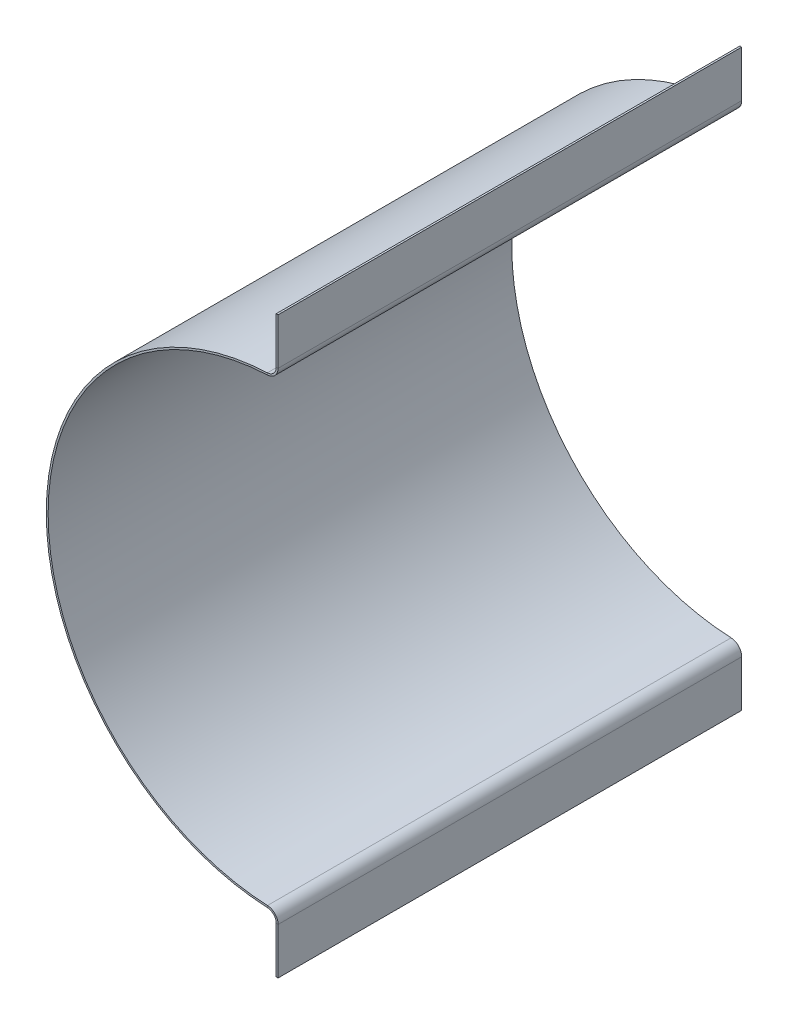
ISO-10303-21;
HEADER;
FILE_DESCRIPTION(('STEP AP214'),'2;1');
FILE_NAME('part.step','',(''),(''),'','','');
FILE_SCHEMA(('AUTOMOTIVE_DESIGN { 1 0 10303 214 1 1 1 1 }'));
ENDSEC;
DATA;
#1=APPLICATION_CONTEXT('core data for automotive mechanical design processes');
#2=APPLICATION_PROTOCOL_DEFINITION('international standard','automotive_design',2000,#1);
#3=PRODUCT_CONTEXT('',#1,'mechanical');
#4=PRODUCT('Part','Part','',(#3));
#5=PRODUCT_RELATED_PRODUCT_CATEGORY('part','',(#4));
#6=PRODUCT_DEFINITION_FORMATION('','',#4);
#7=PRODUCT_DEFINITION_CONTEXT('part definition',#1,'design');
#8=PRODUCT_DEFINITION('design','',#6,#7);
#9=PRODUCT_DEFINITION_SHAPE('','',#8);
#10=(LENGTH_UNIT() NAMED_UNIT(*) SI_UNIT(.MILLI.,.METRE.));
#11=(NAMED_UNIT(*) PLANE_ANGLE_UNIT() SI_UNIT($,.RADIAN.));
#12=(NAMED_UNIT(*) SI_UNIT($,.STERADIAN.) SOLID_ANGLE_UNIT());
#13=UNCERTAINTY_MEASURE_WITH_UNIT(LENGTH_MEASURE(1.E-05),#10,'distance_accuracy_value','');
#14=(GEOMETRIC_REPRESENTATION_CONTEXT(3) GLOBAL_UNCERTAINTY_ASSIGNED_CONTEXT((#13)) GLOBAL_UNIT_ASSIGNED_CONTEXT((#10,
#11,#12)) REPRESENTATION_CONTEXT('',''));
#15=CARTESIAN_POINT('',(0.,0.,0.));
#16=DIRECTION('',(0.,0.,1.));
#17=DIRECTION('',(1.,0.,0.));
#18=AXIS2_PLACEMENT_3D('',#15,#16,#17);
#19=CARTESIAN_POINT('',(-1.016,-157.339248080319,254.));
#20=DIRECTION('',(-1.,0.,0.));
#21=DIRECTION('',(0.,-1.,0.));
#22=AXIS2_PLACEMENT_3D('',#19,#20,#21);
#23=PLANE('',#22);
#24=DIRECTION('',(0.,0.,1.));
#25=VECTOR('',#24,1.);
#26=CARTESIAN_POINT('',(-1.01599999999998,-144.639248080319,254.));
#27=LINE('',#26,#25);
#28=CARTESIAN_POINT('',(-1.01599999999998,-144.639248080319,215.9));
#29=VERTEX_POINT('',#28);
#30=CARTESIAN_POINT('',(-1.01599999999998,-144.639248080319,241.3));
#31=VERTEX_POINT('',#30);
#32=EDGE_CURVE('E49',#29,#31,#27,.T.);
#33=ORIENTED_EDGE('',*,*,#32,.T.);
#34=DIRECTION('',(0.,1.,0.));
#35=VECTOR('',#34,1.);
#36=CARTESIAN_POINT('',(-1.016,-157.339248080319,241.3));
#37=LINE('',#36,#35);
#38=CARTESIAN_POINT('',(-1.01599999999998,-131.939248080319,241.3));
#39=VERTEX_POINT('',#38);
#40=EDGE_CURVE('E11',#31,#39,#37,.T.);
#41=ORIENTED_EDGE('',*,*,#40,.T.);
#42=DIRECTION('',(0.,0.,-1.));
#43=VECTOR('',#42,1.);
#44=CARTESIAN_POINT('',(-1.01599999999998,-131.939248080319,254.));
#45=LINE('',#44,#43);
#46=CARTESIAN_POINT('',(-1.01599999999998,-131.939248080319,215.9));
#47=VERTEX_POINT('',#46);
#48=EDGE_CURVE('E291',#39,#47,#45,.T.);
#49=ORIENTED_EDGE('',*,*,#48,.T.);
#50=DIRECTION('',(0.,-1.,0.));
#51=VECTOR('',#50,1.);
#52=CARTESIAN_POINT('',(-1.016,-157.339248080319,215.9));
#53=LINE('',#52,#51);
#54=EDGE_CURVE('E359',#47,#29,#53,.T.);
#55=ORIENTED_EDGE('',*,*,#54,.T.);
#56=EDGE_LOOP('',(#33,#41,#49,#55));
#57=FACE_BOUND('',#56,.T.);
#58=ADVANCED_FACE('F40',(#57),#23,.T.);
#59=DIRECTION('',(0.,0.,1.));
#60=VECTOR('',#59,1.);
#61=CARTESIAN_POINT('',(-1.01599999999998,-144.639248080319,254.));
#62=LINE('',#61,#60);
#63=CARTESIAN_POINT('',(-1.01599999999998,-144.639248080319,165.1));
#64=VERTEX_POINT('',#63);
#65=CARTESIAN_POINT('',(-1.01599999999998,-144.639248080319,190.5));
#66=VERTEX_POINT('',#65);
#67=EDGE_CURVE('E352',#64,#66,#62,.T.);
#68=ORIENTED_EDGE('',*,*,#67,.T.);
#69=DIRECTION('',(0.,1.,0.));
#70=VECTOR('',#69,1.);
#71=CARTESIAN_POINT('',(-1.016,-157.339248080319,190.5));
#72=LINE('',#71,#70);
#73=CARTESIAN_POINT('',(-1.01599999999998,-131.939248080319,190.5));
#74=VERTEX_POINT('',#73);
#75=EDGE_CURVE('E356',#66,#74,#72,.T.);
#76=ORIENTED_EDGE('',*,*,#75,.T.);
#77=CARTESIAN_POINT('',(-1.01599999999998,-131.939248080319,165.1));
#78=VERTEX_POINT('',#77);
#79=EDGE_CURVE('E378',#74,#78,#45,.T.);
#80=ORIENTED_EDGE('',*,*,#79,.T.);
#81=DIRECTION('',(0.,-1.,0.));
#82=VECTOR('',#81,1.);
#83=CARTESIAN_POINT('',(-1.016,-157.339248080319,165.1));
#84=LINE('',#83,#82);
#85=EDGE_CURVE('E348',#78,#64,#84,.T.);
#86=ORIENTED_EDGE('',*,*,#85,.T.);
#87=EDGE_LOOP('',(#68,#76,#80,#86));
#88=FACE_BOUND('',#87,.T.);
#89=ADVANCED_FACE('F464',(#88),#23,.T.);
#90=DIRECTION('',(0.,0.,1.));
#91=VECTOR('',#90,1.);
#92=CARTESIAN_POINT('',(-1.01599999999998,-144.639248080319,254.));
#93=LINE('',#92,#91);
#94=CARTESIAN_POINT('',(-1.01599999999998,-144.639248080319,114.3));
#95=VERTEX_POINT('',#94);
#96=CARTESIAN_POINT('',(-1.01599999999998,-144.639248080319,139.7));
#97=VERTEX_POINT('',#96);
#98=EDGE_CURVE('E341',#95,#97,#93,.T.);
#99=ORIENTED_EDGE('',*,*,#98,.T.);
#100=DIRECTION('',(0.,1.,0.));
#101=VECTOR('',#100,1.);
#102=CARTESIAN_POINT('',(-1.016,-157.339248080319,139.7));
#103=LINE('',#102,#101);
#104=CARTESIAN_POINT('',(-1.01599999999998,-131.939248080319,139.7));
#105=VERTEX_POINT('',#104);
#106=EDGE_CURVE('E345',#97,#105,#103,.T.);
#107=ORIENTED_EDGE('',*,*,#106,.T.);
#108=CARTESIAN_POINT('',(-1.01599999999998,-131.939248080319,114.3));
#109=VERTEX_POINT('',#108);
#110=EDGE_CURVE('E382',#105,#109,#45,.T.);
#111=ORIENTED_EDGE('',*,*,#110,.T.);
#112=DIRECTION('',(0.,-1.,0.));
#113=VECTOR('',#112,1.);
#114=CARTESIAN_POINT('',(-1.016,-157.339248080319,114.3));
#115=LINE('',#114,#113);
#116=EDGE_CURVE('E337',#109,#95,#115,.T.);
#117=ORIENTED_EDGE('',*,*,#116,.T.);
#118=EDGE_LOOP('',(#99,#107,#111,#117));
#119=FACE_BOUND('',#118,.T.);
#120=ADVANCED_FACE('F469',(#119),#23,.T.);
#121=DIRECTION('',(0.,0.,1.));
#122=VECTOR('',#121,1.);
#123=CARTESIAN_POINT('',(-1.01599999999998,-144.639248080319,254.));
#124=LINE('',#123,#122);
#125=CARTESIAN_POINT('',(-1.01599999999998,-144.639248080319,63.5));
#126=VERTEX_POINT('',#125);
#127=CARTESIAN_POINT('',(-1.01599999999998,-144.639248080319,88.9));
#128=VERTEX_POINT('',#127);
#129=EDGE_CURVE('E330',#126,#128,#124,.T.);
#130=ORIENTED_EDGE('',*,*,#129,.T.);
#131=DIRECTION('',(0.,1.,0.));
#132=VECTOR('',#131,1.);
#133=CARTESIAN_POINT('',(-1.016,-157.339248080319,88.9));
#134=LINE('',#133,#132);
#135=CARTESIAN_POINT('',(-1.01599999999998,-131.939248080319,88.9));
#136=VERTEX_POINT('',#135);
#137=EDGE_CURVE('E334',#128,#136,#134,.T.);
#138=ORIENTED_EDGE('',*,*,#137,.T.);
#139=CARTESIAN_POINT('',(-1.01599999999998,-131.939248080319,63.5));
#140=VERTEX_POINT('',#139);
#141=EDGE_CURVE('E388',#136,#140,#45,.T.);
#142=ORIENTED_EDGE('',*,*,#141,.T.);
#143=DIRECTION('',(0.,-1.,0.));
#144=VECTOR('',#143,1.);
#145=CARTESIAN_POINT('',(-1.016,-157.339248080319,63.4999999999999));
#146=LINE('',#145,#144);
#147=EDGE_CURVE('E326',#140,#126,#146,.T.);
#148=ORIENTED_EDGE('',*,*,#147,.T.);
#149=EDGE_LOOP('',(#130,#138,#142,#148));
#150=FACE_BOUND('',#149,.T.);
#151=ADVANCED_FACE('F480',(#150),#23,.T.);
#152=DIRECTION('',(0.,0.,1.));
#153=VECTOR('',#152,1.);
#154=CARTESIAN_POINT('',(-1.01599999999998,-144.639248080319,254.));
#155=LINE('',#154,#153);
#156=CARTESIAN_POINT('',(-1.01599999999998,-144.639248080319,12.7));
#157=VERTEX_POINT('',#156);
#158=CARTESIAN_POINT('',(-1.01599999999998,-144.639248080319,38.1));
#159=VERTEX_POINT('',#158);
#160=EDGE_CURVE('E319',#157,#159,#155,.T.);
#161=ORIENTED_EDGE('',*,*,#160,.T.);
#162=DIRECTION('',(0.,1.,0.));
#163=VECTOR('',#162,1.);
#164=CARTESIAN_POINT('',(-1.016,-157.339248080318,38.0999999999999));
#165=LINE('',#164,#163);
#166=CARTESIAN_POINT('',(-1.01599999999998,-131.939248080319,38.1));
#167=VERTEX_POINT('',#166);
#168=EDGE_CURVE('E323',#159,#167,#165,.T.);
#169=ORIENTED_EDGE('',*,*,#168,.T.);
#170=CARTESIAN_POINT('',(-1.01599999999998,-131.939248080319,12.7));
#171=VERTEX_POINT('',#170);
#172=EDGE_CURVE('E395',#167,#171,#45,.T.);
#173=ORIENTED_EDGE('',*,*,#172,.T.);
#174=DIRECTION('',(0.,-1.,0.));
#175=VECTOR('',#174,1.);
#176=CARTESIAN_POINT('',(-1.016,-157.339248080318,12.6999999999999));
#177=LINE('',#176,#175);
#178=EDGE_CURVE('E315',#171,#157,#177,.T.);
#179=ORIENTED_EDGE('',*,*,#178,.T.);
#180=EDGE_LOOP('',(#161,#169,#173,#179));
#181=FACE_BOUND('',#180,.T.);
#182=ADVANCED_FACE('F473',(#181),#23,.T.);
#183=CARTESIAN_POINT('',(-1.016,131.939248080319,254.));
#184=DIRECTION('',(0.,0.,1.));
#185=DIRECTION('',(1.,0.,0.));
#186=AXIS2_PLACEMENT_3D('',#183,#184,#185);
#187=PLANE('',#186);
#188=DIRECTION('',(1.,0.,0.));
#189=VECTOR('',#188,1.);
#190=CARTESIAN_POINT('',(-1.016,131.939248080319,254.));
#191=LINE('',#190,#189);
#192=CARTESIAN_POINT('',(-1.016,131.939248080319,254.));
#193=VERTEX_POINT('',#192);
#194=CARTESIAN_POINT('',(0.,131.939248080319,254.));
#195=VERTEX_POINT('',#194);
#196=EDGE_CURVE('E192',#193,#195,#191,.T.);
#197=ORIENTED_EDGE('',*,*,#196,.F.);
#198=CARTESIAN_POINT('',(-6.096,131.939248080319,254.));
#199=DIRECTION('',(0.,0.,1.));
#200=DIRECTION('',(-1.,0.,0.));
#201=AXIS2_PLACEMENT_3D('',#198,#199,#200);
#202=CIRCLE('',#201,5.08);
#203=CARTESIAN_POINT('',(-5.86153846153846,126.864661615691,254.));
#204=VERTEX_POINT('',#203);
#205=EDGE_CURVE('E212',#204,#193,#202,.T.);
#206=ORIENTED_EDGE('',*,*,#205,.F.);
#207=DIRECTION('',(0.0461538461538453,-0.998934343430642,0.));
#208=VECTOR('',#207,1.);
#209=CARTESIAN_POINT('',(-5.86153846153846,126.864661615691,254.));
#210=LINE('',#209,#208);
#211=CARTESIAN_POINT('',(-5.81464615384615,125.849744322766,254.));
#212=VERTEX_POINT('',#211);
#213=EDGE_CURVE('E310',#204,#212,#210,.T.);
#214=ORIENTED_EDGE('',*,*,#213,.T.);
#215=CARTESIAN_POINT('',(-6.096,131.939248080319,254.));
#216=DIRECTION('',(0.,0.,1.));
#217=DIRECTION('',(1.,0.,0.));
#218=AXIS2_PLACEMENT_3D('',#215,#216,#217);
#219=CIRCLE('',#218,6.096);
#220=EDGE_CURVE('E238',#212,#195,#219,.T.);
#221=ORIENTED_EDGE('',*,*,#220,.T.);
#222=EDGE_LOOP('',(#197,#206,#214,#221));
#223=FACE_BOUND('',#222,.T.);
#224=ADVANCED_FACE('F42',(#223),#187,.T.);
#225=CARTESIAN_POINT('',(0.,131.939248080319,0.));
#226=DIRECTION('',(0.,0.,-1.));
#227=DIRECTION('',(-1.,0.,0.));
#228=AXIS2_PLACEMENT_3D('',#225,#226,#227);
#229=PLANE('',#228);
#230=DIRECTION('',(-1.,0.,0.));
#231=VECTOR('',#230,1.);
#232=CARTESIAN_POINT('',(0.,131.939248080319,0.));
#233=LINE('',#232,#231);
#234=CARTESIAN_POINT('',(0.,131.939248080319,0.));
#235=VERTEX_POINT('',#234);
#236=CARTESIAN_POINT('',(-1.016,131.939248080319,0.));
#237=VERTEX_POINT('',#236);
#238=EDGE_CURVE('E312',#235,#237,#233,.T.);
#239=ORIENTED_EDGE('',*,*,#238,.F.);
#240=CARTESIAN_POINT('',(-6.096,131.939248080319,0.));
#241=DIRECTION('',(0.,0.,1.));
#242=DIRECTION('',(1.,0.,0.));
#243=AXIS2_PLACEMENT_3D('',#240,#241,#242);
#244=CIRCLE('',#243,6.096);
#245=CARTESIAN_POINT('',(-5.81464615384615,125.849744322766,0.));
#246=VERTEX_POINT('',#245);
#247=EDGE_CURVE('E196',#246,#235,#244,.T.);
#248=ORIENTED_EDGE('',*,*,#247,.F.);
#249=DIRECTION('',(-0.0461538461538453,0.998934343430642,0.));
#250=VECTOR('',#249,1.);
#251=CARTESIAN_POINT('',(-5.81464615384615,125.849744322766,0.));
#252=LINE('',#251,#250);
#253=CARTESIAN_POINT('',(-5.86153846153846,126.864661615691,0.));
#254=VERTEX_POINT('',#253);
#255=EDGE_CURVE('E308',#246,#254,#252,.T.);
#256=ORIENTED_EDGE('',*,*,#255,.T.);
#257=CARTESIAN_POINT('',(-6.096,131.939248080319,0.));
#258=DIRECTION('',(0.,0.,1.));
#259=DIRECTION('',(-1.,0.,0.));
#260=AXIS2_PLACEMENT_3D('',#257,#258,#259);
#261=CIRCLE('',#260,5.08);
#262=EDGE_CURVE('E247',#254,#237,#261,.T.);
#263=ORIENTED_EDGE('',*,*,#262,.T.);
#264=EDGE_LOOP('',(#239,#248,#256,#263));
#265=FACE_BOUND('',#264,.T.);
#266=ADVANCED_FACE('F446',(#265),#229,.T.);
#267=CARTESIAN_POINT('',(-5.86153846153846,126.864661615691,254.));
#268=DIRECTION('',(0.,0.,1.));
#269=DIRECTION('',(1.,0.,0.));
#270=AXIS2_PLACEMENT_3D('',#267,#268,#269);
#271=PLANE('',#270);
#272=ORIENTED_EDGE('',*,*,#213,.F.);
#273=CARTESIAN_POINT('',(0.,0.,254.));
#274=DIRECTION('',(0.,0.,-1.));
#275=DIRECTION('',(1.,0.,0.));
#276=AXIS2_PLACEMENT_3D('',#273,#274,#275);
#277=CIRCLE('',#276,127.);
#278=CARTESIAN_POINT('',(-5.86153846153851,-126.864661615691,254.));
#279=VERTEX_POINT('',#278);
#280=EDGE_CURVE('E217',#279,#204,#277,.T.);
#281=ORIENTED_EDGE('',*,*,#280,.F.);
#282=DIRECTION('',(0.0461538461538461,0.998934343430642,0.));
#283=VECTOR('',#282,1.);
#284=CARTESIAN_POINT('',(-5.86153846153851,-126.864661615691,254.));
#285=LINE('',#284,#283);
#286=CARTESIAN_POINT('',(-5.8146461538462,-125.849744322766,254.));
#287=VERTEX_POINT('',#286);
#288=EDGE_CURVE('E306',#279,#287,#285,.T.);
#289=ORIENTED_EDGE('',*,*,#288,.T.);
#290=CARTESIAN_POINT('',(0.,0.,254.));
#291=DIRECTION('',(0.,0.,1.));
#292=DIRECTION('',(1.,0.,0.));
#293=AXIS2_PLACEMENT_3D('',#290,#291,#292);
#294=CIRCLE('',#293,125.984);
#295=EDGE_CURVE('E235',#287,#212,#294,.F.);
#296=ORIENTED_EDGE('',*,*,#295,.T.);
#297=EDGE_LOOP('',(#272,#281,#289,#296));
#298=FACE_BOUND('',#297,.T.);
#299=ADVANCED_FACE('F429',(#298),#271,.T.);
#300=CARTESIAN_POINT('',(-5.81464615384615,125.849744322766,0.));
#301=DIRECTION('',(0.,0.,-1.));
#302=DIRECTION('',(-1.,0.,0.));
#303=AXIS2_PLACEMENT_3D('',#300,#301,#302);
#304=PLANE('',#303);
#305=ORIENTED_EDGE('',*,*,#255,.F.);
#306=CARTESIAN_POINT('',(0.,0.,0.));
#307=DIRECTION('',(0.,0.,1.));
#308=DIRECTION('',(1.,0.,0.));
#309=AXIS2_PLACEMENT_3D('',#306,#307,#308);
#310=CIRCLE('',#309,125.984);
#311=CARTESIAN_POINT('',(-5.8146461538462,-125.849744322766,0.));
#312=VERTEX_POINT('',#311);
#313=EDGE_CURVE('E268',#312,#246,#310,.F.);
#314=ORIENTED_EDGE('',*,*,#313,.F.);
#315=DIRECTION('',(-0.0461538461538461,-0.998934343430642,0.));
#316=VECTOR('',#315,1.);
#317=CARTESIAN_POINT('',(-5.8146461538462,-125.849744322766,0.));
#318=LINE('',#317,#316);
#319=CARTESIAN_POINT('',(-5.86153846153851,-126.864661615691,0.));
#320=VERTEX_POINT('',#319);
#321=EDGE_CURVE('E206',#312,#320,#318,.T.);
#322=ORIENTED_EDGE('',*,*,#321,.T.);
#323=CARTESIAN_POINT('',(0.,0.,0.));
#324=DIRECTION('',(0.,0.,-1.));
#325=DIRECTION('',(1.,0.,0.));
#326=AXIS2_PLACEMENT_3D('',#323,#324,#325);
#327=CIRCLE('',#326,127.);
#328=EDGE_CURVE('E250',#320,#254,#327,.T.);
#329=ORIENTED_EDGE('',*,*,#328,.T.);
#330=EDGE_LOOP('',(#305,#314,#322,#329));
#331=FACE_BOUND('',#330,.T.);
#332=ADVANCED_FACE('F450',(#331),#304,.T.);
#333=CARTESIAN_POINT('',(-5.86153846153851,-126.864661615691,254.));
#334=DIRECTION('',(0.,0.,1.));
#335=DIRECTION('',(1.,0.,0.));
#336=AXIS2_PLACEMENT_3D('',#333,#334,#335);
#337=PLANE('',#336);
#338=ORIENTED_EDGE('',*,*,#288,.F.);
#339=CARTESIAN_POINT('',(-6.09599999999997,-131.939248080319,254.));
#340=DIRECTION('',(0.,0.,1.));
#341=DIRECTION('',(1.,0.,0.));
#342=AXIS2_PLACEMENT_3D('',#339,#340,#341);
#343=CIRCLE('',#342,5.07999999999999);
#344=CARTESIAN_POINT('',(-1.01599999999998,-131.939248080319,254.));
#345=VERTEX_POINT('',#344);
#346=EDGE_CURVE('E220',#345,#279,#343,.T.);
#347=ORIENTED_EDGE('',*,*,#346,.F.);
#348=DIRECTION('',(-1.,0.,0.));
#349=VECTOR('',#348,1.);
#350=CARTESIAN_POINT('',(0.,-131.939248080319,254.));
#351=LINE('',#350,#349);
#352=CARTESIAN_POINT('',(0.,-131.939248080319,254.));
#353=VERTEX_POINT('',#352);
#354=EDGE_CURVE('E304',#353,#345,#351,.T.);
#355=ORIENTED_EDGE('',*,*,#354,.F.);
#356=CARTESIAN_POINT('',(-6.09599999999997,-131.939248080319,254.));
#357=DIRECTION('',(0.,0.,1.));
#358=DIRECTION('',(1.,0.,0.));
#359=AXIS2_PLACEMENT_3D('',#356,#357,#358);
#360=CIRCLE('',#359,6.09599999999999);
#361=EDGE_CURVE('E232',#353,#287,#360,.T.);
#362=ORIENTED_EDGE('',*,*,#361,.T.);
#363=EDGE_LOOP('',(#338,#347,#355,#362));
#364=FACE_BOUND('',#363,.T.);
#365=ADVANCED_FACE('F422',(#364),#337,.T.);
#366=CARTESIAN_POINT('',(0.,-131.939248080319,254.));
#367=DIRECTION('',(0.,0.,1.));
#368=DIRECTION('',(1.,0.,0.));
#369=AXIS2_PLACEMENT_3D('',#366,#367,#368);
#370=PLANE('',#369);
#371=DIRECTION('',(0.,1.,0.));
#372=VECTOR('',#371,1.);
#373=CARTESIAN_POINT('',(-1.016,157.339248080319,254.));
#374=LINE('',#373,#372);
#375=CARTESIAN_POINT('',(-1.016,157.339248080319,254.));
#376=VERTEX_POINT('',#375);
#377=EDGE_CURVE('E210',#193,#376,#374,.T.);
#378=ORIENTED_EDGE('',*,*,#377,.F.);
#379=ORIENTED_EDGE('',*,*,#196,.T.);
#380=DIRECTION('',(0.,1.,0.));
#381=VECTOR('',#380,1.);
#382=CARTESIAN_POINT('',(0.,157.339248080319,254.));
#383=LINE('',#382,#381);
#384=CARTESIAN_POINT('',(0.,157.339248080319,254.));
#385=VERTEX_POINT('',#384);
#386=EDGE_CURVE('E185',#195,#385,#383,.T.);
#387=ORIENTED_EDGE('',*,*,#386,.T.);
#388=DIRECTION('',(1.,0.,0.));
#389=VECTOR('',#388,1.);
#390=CARTESIAN_POINT('',(-1.016,157.339248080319,254.));
#391=LINE('',#390,#389);
#392=EDGE_CURVE('E190',#376,#385,#391,.T.);
#393=ORIENTED_EDGE('',*,*,#392,.F.);
#394=EDGE_LOOP('',(#378,#379,#387,#393));
#395=FACE_BOUND('',#394,.T.);
#396=ADVANCED_FACE('F188',(#395),#370,.T.);
#397=CARTESIAN_POINT('',(-1.01599999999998,-131.939248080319,0.));
#398=DIRECTION('',(0.,0.,-1.));
#399=DIRECTION('',(-1.,0.,0.));
#400=AXIS2_PLACEMENT_3D('',#397,#398,#399);
#401=PLANE('',#400);
#402=DIRECTION('',(1.,0.,0.));
#403=VECTOR('',#402,1.);
#404=CARTESIAN_POINT('',(-1.01599999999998,-131.939248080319,0.));
#405=LINE('',#404,#403);
#406=CARTESIAN_POINT('',(-1.01599999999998,-131.939248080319,0.));
#407=VERTEX_POINT('',#406);
#408=CARTESIAN_POINT('',(0.,-131.939248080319,0.));
#409=VERTEX_POINT('',#408);
#410=EDGE_CURVE('E302',#407,#409,#405,.T.);
#411=ORIENTED_EDGE('',*,*,#410,.F.);
#412=CARTESIAN_POINT('',(-6.09599999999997,-131.939248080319,0.));
#413=DIRECTION('',(0.,0.,1.));
#414=DIRECTION('',(1.,0.,0.));
#415=AXIS2_PLACEMENT_3D('',#412,#413,#414);
#416=CIRCLE('',#415,5.07999999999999);
#417=EDGE_CURVE('E253',#407,#320,#416,.T.);
#418=ORIENTED_EDGE('',*,*,#417,.T.);
#419=ORIENTED_EDGE('',*,*,#321,.F.);
#420=CARTESIAN_POINT('',(-6.09599999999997,-131.939248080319,0.));
#421=DIRECTION('',(0.,0.,1.));
#422=DIRECTION('',(1.,0.,0.));
#423=AXIS2_PLACEMENT_3D('',#420,#421,#422);
#424=CIRCLE('',#423,6.09599999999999);
#425=EDGE_CURVE('E265',#409,#312,#424,.T.);
#426=ORIENTED_EDGE('',*,*,#425,.F.);
#427=EDGE_LOOP('',(#411,#418,#419,#426));
#428=FACE_BOUND('',#427,.T.);
#429=ADVANCED_FACE('F405',(#428),#401,.T.);
#430=CARTESIAN_POINT('',(-5.8146461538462,-125.849744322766,0.));
#431=DIRECTION('',(0.,0.,-1.));
#432=DIRECTION('',(-1.,0.,0.));
#433=AXIS2_PLACEMENT_3D('',#430,#431,#432);
#434=PLANE('',#433);
#435=DIRECTION('',(0.,1.,0.));
#436=VECTOR('',#435,1.);
#437=CARTESIAN_POINT('',(-1.016,-157.339248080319,0.));
#438=LINE('',#437,#436);
#439=CARTESIAN_POINT('',(-1.016,-157.339248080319,0.));
#440=VERTEX_POINT('',#439);
#441=EDGE_CURVE('E256',#440,#407,#438,.T.);
#442=ORIENTED_EDGE('',*,*,#441,.T.);
#443=ORIENTED_EDGE('',*,*,#410,.T.);
#444=DIRECTION('',(0.,1.,0.));
#445=VECTOR('',#444,1.);
#446=CARTESIAN_POINT('',(0.,-157.339248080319,0.));
#447=LINE('',#446,#445);
#448=CARTESIAN_POINT('',(0.,-157.339248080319,0.));
#449=VERTEX_POINT('',#448);
#450=EDGE_CURVE('E262',#449,#409,#447,.T.);
#451=ORIENTED_EDGE('',*,*,#450,.F.);
#452=DIRECTION('',(-1.,0.,0.));
#453=VECTOR('',#452,1.);
#454=CARTESIAN_POINT('',(0.,-157.339248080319,0.));
#455=LINE('',#454,#453);
#456=EDGE_CURVE('E259',#449,#440,#455,.T.);
#457=ORIENTED_EDGE('',*,*,#456,.T.);
#458=EDGE_LOOP('',(#442,#443,#451,#457));
#459=FACE_BOUND('',#458,.T.);
#460=ADVANCED_FACE('F410',(#459),#434,.T.);
#461=CARTESIAN_POINT('',(0.,157.339248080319,254.));
#462=DIRECTION('',(-1.,0.,0.));
#463=DIRECTION('',(0.,-1.,0.));
#464=AXIS2_PLACEMENT_3D('',#461,#462,#463);
#465=PLANE('',#464);
#466=DIRECTION('',(0.,1.,0.));
#467=VECTOR('',#466,1.);
#468=CARTESIAN_POINT('',(0.,157.339248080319,0.));
#469=LINE('',#468,#467);
#470=CARTESIAN_POINT('',(0.,157.339248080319,0.));
#471=VERTEX_POINT('',#470);
#472=EDGE_CURVE('E202',#235,#471,#469,.T.);
#473=ORIENTED_EDGE('',*,*,#472,.T.);
#474=DIRECTION('',(0.,0.,-1.));
#475=VECTOR('',#474,1.);
#476=CARTESIAN_POINT('',(0.,157.339248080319,254.));
#477=LINE('',#476,#475);
#478=EDGE_CURVE('E199',#385,#471,#477,.T.);
#479=ORIENTED_EDGE('',*,*,#478,.F.);
#480=ORIENTED_EDGE('',*,*,#386,.F.);
#481=DIRECTION('',(0.,0.,-1.));
#482=VECTOR('',#481,1.);
#483=CARTESIAN_POINT('',(0.,131.939248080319,254.));
#484=LINE('',#483,#482);
#485=EDGE_CURVE('E240',#195,#235,#484,.T.);
#486=ORIENTED_EDGE('',*,*,#485,.T.);
#487=EDGE_LOOP('',(#473,#479,#480,#486));
#488=FACE_BOUND('',#487,.T.);
#489=ADVANCED_FACE('F200',(#488),#465,.F.);
#490=CARTESIAN_POINT('',(-1.016,157.339248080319,254.));
#491=DIRECTION('',(0.,1.,0.));
#492=DIRECTION('',(0.,0.,1.));
#493=AXIS2_PLACEMENT_3D('',#490,#491,#492);
#494=PLANE('',#493);
#495=DIRECTION('',(1.,0.,0.));
#496=VECTOR('',#495,1.);
#497=CARTESIAN_POINT('',(-1.016,157.339248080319,0.));
#498=LINE('',#497,#496);
#499=CARTESIAN_POINT('',(-1.016,157.339248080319,0.));
#500=VERTEX_POINT('',#499);
#501=EDGE_CURVE('E242',#500,#471,#498,.T.);
#502=ORIENTED_EDGE('',*,*,#501,.F.);
#503=DIRECTION('',(0.,0.,-1.));
#504=VECTOR('',#503,1.);
#505=CARTESIAN_POINT('',(-1.016,157.339248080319,254.));
#506=LINE('',#505,#504);
#507=EDGE_CURVE('E207',#376,#500,#506,.T.);
#508=ORIENTED_EDGE('',*,*,#507,.F.);
#509=ORIENTED_EDGE('',*,*,#392,.T.);
#510=ORIENTED_EDGE('',*,*,#478,.T.);
#511=EDGE_LOOP('',(#502,#508,#509,#510));
#512=FACE_BOUND('',#511,.T.);
#513=ADVANCED_FACE('F209',(#512),#494,.T.);
#514=CARTESIAN_POINT('',(-1.016,157.339248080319,254.));
#515=DIRECTION('',(-1.,0.,0.));
#516=DIRECTION('',(0.,-1.,0.));
#517=AXIS2_PLACEMENT_3D('',#514,#515,#516);
#518=PLANE('',#517);
#519=DIRECTION('',(0.,1.,0.));
#520=VECTOR('',#519,1.);
#521=CARTESIAN_POINT('',(-1.016,157.339248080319,0.));
#522=LINE('',#521,#520);
#523=EDGE_CURVE('E244',#237,#500,#522,.T.);
#524=ORIENTED_EDGE('',*,*,#523,.F.);
#525=DIRECTION('',(0.,0.,-1.));
#526=VECTOR('',#525,1.);
#527=CARTESIAN_POINT('',(-1.016,131.939248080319,254.));
#528=LINE('',#527,#526);
#529=EDGE_CURVE('E297',#193,#237,#528,.T.);
#530=ORIENTED_EDGE('',*,*,#529,.F.);
#531=ORIENTED_EDGE('',*,*,#377,.T.);
#532=ORIENTED_EDGE('',*,*,#507,.T.);
#533=EDGE_LOOP('',(#524,#530,#531,#532));
#534=FACE_BOUND('',#533,.T.);
#535=ADVANCED_FACE('F443',(#534),#518,.T.);
#536=CARTESIAN_POINT('',(-6.096,131.939248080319,254.));
#537=DIRECTION('',(0.,0.,-1.));
#538=DIRECTION('',(-1.,0.,0.));
#539=AXIS2_PLACEMENT_3D('',#536,#537,#538);
#540=CYLINDRICAL_SURFACE('',#539,5.08);
#541=ORIENTED_EDGE('',*,*,#262,.F.);
#542=DIRECTION('',(0.,0.,-1.));
#543=VECTOR('',#542,1.);
#544=CARTESIAN_POINT('',(-5.86153846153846,126.864661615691,254.));
#545=LINE('',#544,#543);
#546=EDGE_CURVE('E294',#204,#254,#545,.T.);
#547=ORIENTED_EDGE('',*,*,#546,.F.);
#548=ORIENTED_EDGE('',*,*,#205,.T.);
#549=ORIENTED_EDGE('',*,*,#529,.T.);
#550=EDGE_LOOP('',(#541,#547,#548,#549));
#551=FACE_BOUND('',#550,.T.);
#552=ADVANCED_FACE('F437',(#551),#540,.F.);
#553=CARTESIAN_POINT('',(0.,0.,254.));
#554=DIRECTION('',(0.,0.,-1.));
#555=DIRECTION('',(-1.,0.,0.));
#556=AXIS2_PLACEMENT_3D('',#553,#554,#555);
#557=CYLINDRICAL_SURFACE('',#556,127.);
#558=ORIENTED_EDGE('',*,*,#328,.F.);
#559=DIRECTION('',(0.,0.,-1.));
#560=VECTOR('',#559,1.);
#561=CARTESIAN_POINT('',(-5.86153846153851,-126.864661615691,254.));
#562=LINE('',#561,#560);
#563=EDGE_CURVE('E290',#279,#320,#562,.T.);
#564=ORIENTED_EDGE('',*,*,#563,.F.);
#565=ORIENTED_EDGE('',*,*,#280,.T.);
#566=ORIENTED_EDGE('',*,*,#546,.T.);
#567=EDGE_LOOP('',(#558,#564,#565,#566));
#568=FACE_BOUND('',#567,.T.);
#569=ADVANCED_FACE('F428',(#568),#557,.T.);
#570=CARTESIAN_POINT('',(-6.09599999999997,-131.939248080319,254.));
#571=DIRECTION('',(0.,0.,-1.));
#572=DIRECTION('',(-1.,0.,0.));
#573=AXIS2_PLACEMENT_3D('',#570,#571,#572);
#574=CYLINDRICAL_SURFACE('',#573,5.07999999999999);
#575=ORIENTED_EDGE('',*,*,#417,.F.);
#576=EDGE_CURVE('E287',#171,#407,#45,.T.);
#577=ORIENTED_EDGE('',*,*,#576,.F.);
#578=ORIENTED_EDGE('',*,*,#172,.F.);
#579=EDGE_CURVE('E391',#140,#167,#45,.T.);
#580=ORIENTED_EDGE('',*,*,#579,.F.);
#581=ORIENTED_EDGE('',*,*,#141,.F.);
#582=EDGE_CURVE('E384',#109,#136,#45,.T.);
#583=ORIENTED_EDGE('',*,*,#582,.F.);
#584=ORIENTED_EDGE('',*,*,#110,.F.);
#585=EDGE_CURVE('E379',#78,#105,#45,.T.);
#586=ORIENTED_EDGE('',*,*,#585,.F.);
#587=ORIENTED_EDGE('',*,*,#79,.F.);
#588=EDGE_CURVE('E370',#47,#74,#45,.T.);
#589=ORIENTED_EDGE('',*,*,#588,.F.);
#590=ORIENTED_EDGE('',*,*,#48,.F.);
#591=EDGE_CURVE('E288',#345,#39,#45,.T.);
#592=ORIENTED_EDGE('',*,*,#591,.F.);
#593=ORIENTED_EDGE('',*,*,#346,.T.);
#594=ORIENTED_EDGE('',*,*,#563,.T.);
#595=EDGE_LOOP('',(#575,#577,#578,#580,#581,#583,#584,#586,#587,#589,#590,#592,#593,#594));
#596=FACE_BOUND('',#595,.T.);
#597=ADVANCED_FACE('F374',(#596),#574,.F.);
#598=ORIENTED_EDGE('',*,*,#40,.F.);
#599=ORIENTED_EDGE('',*,*,#32,.F.);
#600=ORIENTED_EDGE('',*,*,#54,.F.);
#601=ORIENTED_EDGE('',*,*,#588,.T.);
#602=ORIENTED_EDGE('',*,*,#75,.F.);
#603=ORIENTED_EDGE('',*,*,#67,.F.);
#604=ORIENTED_EDGE('',*,*,#85,.F.);
#605=ORIENTED_EDGE('',*,*,#585,.T.);
#606=ORIENTED_EDGE('',*,*,#106,.F.);
#607=ORIENTED_EDGE('',*,*,#98,.F.);
#608=ORIENTED_EDGE('',*,*,#116,.F.);
#609=ORIENTED_EDGE('',*,*,#582,.T.);
#610=ORIENTED_EDGE('',*,*,#137,.F.);
#611=ORIENTED_EDGE('',*,*,#129,.F.);
#612=ORIENTED_EDGE('',*,*,#147,.F.);
#613=ORIENTED_EDGE('',*,*,#579,.T.);
#614=ORIENTED_EDGE('',*,*,#168,.F.);
#615=ORIENTED_EDGE('',*,*,#160,.F.);
#616=ORIENTED_EDGE('',*,*,#178,.F.);
#617=ORIENTED_EDGE('',*,*,#576,.T.);
#618=ORIENTED_EDGE('',*,*,#441,.F.);
#619=DIRECTION('',(0.,0.,-1.));
#620=VECTOR('',#619,1.);
#621=CARTESIAN_POINT('',(-1.016,-157.339248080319,254.));
#622=LINE('',#621,#620);
#623=CARTESIAN_POINT('',(-1.016,-157.339248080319,254.));
#624=VERTEX_POINT('',#623);
#625=EDGE_CURVE('E285',#624,#440,#622,.T.);
#626=ORIENTED_EDGE('',*,*,#625,.F.);
#627=DIRECTION('',(0.,1.,0.));
#628=VECTOR('',#627,1.);
#629=CARTESIAN_POINT('',(-1.016,-157.339248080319,254.));
#630=LINE('',#629,#628);
#631=EDGE_CURVE('E223',#624,#345,#630,.T.);
#632=ORIENTED_EDGE('',*,*,#631,.T.);
#633=ORIENTED_EDGE('',*,*,#591,.T.);
#634=EDGE_LOOP('',(#598,#599,#600,#601,#602,#603,#604,#605,#606,#607,#608,#609,#610,#611,#612,
#613,#614,#615,#616,#617,#618,#626,#632,#633));
#635=FACE_BOUND('',#634,.T.);
#636=ADVANCED_FACE('F369',(#635),#23,.T.);
#637=CARTESIAN_POINT('',(0.,-157.339248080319,254.));
#638=DIRECTION('',(0.,-1.,0.));
#639=DIRECTION('',(0.,0.,-1.));
#640=AXIS2_PLACEMENT_3D('',#637,#638,#639);
#641=PLANE('',#640);
#642=ORIENTED_EDGE('',*,*,#456,.F.);
#643=DIRECTION('',(0.,0.,-1.));
#644=VECTOR('',#643,1.);
#645=CARTESIAN_POINT('',(0.,-157.339248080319,254.));
#646=LINE('',#645,#644);
#647=CARTESIAN_POINT('',(0.,-157.339248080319,254.));
#648=VERTEX_POINT('',#647);
#649=EDGE_CURVE('E283',#648,#449,#646,.T.);
#650=ORIENTED_EDGE('',*,*,#649,.F.);
#651=DIRECTION('',(-1.,0.,0.));
#652=VECTOR('',#651,1.);
#653=CARTESIAN_POINT('',(0.,-157.339248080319,254.));
#654=LINE('',#653,#652);
#655=EDGE_CURVE('E226',#648,#624,#654,.T.);
#656=ORIENTED_EDGE('',*,*,#655,.T.);
#657=ORIENTED_EDGE('',*,*,#625,.T.);
#658=EDGE_LOOP('',(#642,#650,#656,#657));
#659=FACE_BOUND('',#658,.T.);
#660=ADVANCED_FACE('F413',(#659),#641,.T.);
#661=CARTESIAN_POINT('',(0.,-157.339248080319,254.));
#662=DIRECTION('',(-1.,0.,0.));
#663=DIRECTION('',(0.,-1.,0.));
#664=AXIS2_PLACEMENT_3D('',#661,#662,#663);
#665=PLANE('',#664);
#666=ORIENTED_EDGE('',*,*,#450,.T.);
#667=DIRECTION('',(0.,0.,-1.));
#668=VECTOR('',#667,1.);
#669=CARTESIAN_POINT('',(0.,-131.939248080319,254.));
#670=LINE('',#669,#668);
#671=EDGE_CURVE('E280',#353,#409,#670,.T.);
#672=ORIENTED_EDGE('',*,*,#671,.F.);
#673=DIRECTION('',(0.,1.,0.));
#674=VECTOR('',#673,1.);
#675=CARTESIAN_POINT('',(0.,-157.339248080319,254.));
#676=LINE('',#675,#674);
#677=EDGE_CURVE('E229',#648,#353,#676,.T.);
#678=ORIENTED_EDGE('',*,*,#677,.F.);
#679=ORIENTED_EDGE('',*,*,#649,.T.);
#680=EDGE_LOOP('',(#666,#672,#678,#679));
#681=FACE_BOUND('',#680,.T.);
#682=ADVANCED_FACE('F478',(#681),#665,.F.);
#683=CARTESIAN_POINT('',(-6.09599999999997,-131.939248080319,254.));
#684=DIRECTION('',(0.,0.,-1.));
#685=DIRECTION('',(-1.,0.,0.));
#686=AXIS2_PLACEMENT_3D('',#683,#684,#685);
#687=CYLINDRICAL_SURFACE('',#686,6.09599999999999);
#688=ORIENTED_EDGE('',*,*,#425,.T.);
#689=DIRECTION('',(0.,0.,-1.));
#690=VECTOR('',#689,1.);
#691=CARTESIAN_POINT('',(-5.8146461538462,-125.849744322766,254.));
#692=LINE('',#691,#690);
#693=EDGE_CURVE('E277',#287,#312,#692,.T.);
#694=ORIENTED_EDGE('',*,*,#693,.F.);
#695=ORIENTED_EDGE('',*,*,#361,.F.);
#696=ORIENTED_EDGE('',*,*,#671,.T.);
#697=EDGE_LOOP('',(#688,#694,#695,#696));
#698=FACE_BOUND('',#697,.T.);
#699=ADVANCED_FACE('F529',(#698),#687,.T.);
#700=CARTESIAN_POINT('',(0.,0.,254.));
#701=DIRECTION('',(0.,0.,-1.));
#702=DIRECTION('',(-1.,0.,0.));
#703=AXIS2_PLACEMENT_3D('',#700,#701,#702);
#704=CYLINDRICAL_SURFACE('',#703,125.984);
#705=ORIENTED_EDGE('',*,*,#313,.T.);
#706=DIRECTION('',(0.,0.,-1.));
#707=VECTOR('',#706,1.);
#708=CARTESIAN_POINT('',(-5.81464615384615,125.849744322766,254.));
#709=LINE('',#708,#707);
#710=EDGE_CURVE('E274',#212,#246,#709,.T.);
#711=ORIENTED_EDGE('',*,*,#710,.F.);
#712=ORIENTED_EDGE('',*,*,#295,.F.);
#713=ORIENTED_EDGE('',*,*,#693,.T.);
#714=EDGE_LOOP('',(#705,#711,#712,#713));
#715=FACE_BOUND('',#714,.T.);
#716=ADVANCED_FACE('F452',(#715),#704,.F.);
#717=CARTESIAN_POINT('',(-6.096,131.939248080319,254.));
#718=DIRECTION('',(0.,0.,-1.));
#719=DIRECTION('',(-1.,0.,0.));
#720=AXIS2_PLACEMENT_3D('',#717,#718,#719);
#721=CYLINDRICAL_SURFACE('',#720,6.096);
#722=ORIENTED_EDGE('',*,*,#247,.T.);
#723=ORIENTED_EDGE('',*,*,#485,.F.);
#724=ORIENTED_EDGE('',*,*,#220,.F.);
#725=ORIENTED_EDGE('',*,*,#710,.T.);
#726=EDGE_LOOP('',(#722,#723,#724,#725));
#727=FACE_BOUND('',#726,.T.);
#728=ADVANCED_FACE('F454',(#727),#721,.T.);
#729=CARTESIAN_POINT('',(-6.096,131.939248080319,254.));
#730=DIRECTION('',(0.,0.,1.));
#731=DIRECTION('',(1.,0.,0.));
#732=AXIS2_PLACEMENT_3D('',#729,#730,#731);
#733=PLANE('',#732);
#734=ORIENTED_EDGE('',*,*,#677,.T.);
#735=ORIENTED_EDGE('',*,*,#354,.T.);
#736=ORIENTED_EDGE('',*,*,#631,.F.);
#737=ORIENTED_EDGE('',*,*,#655,.F.);
#738=EDGE_LOOP('',(#734,#735,#736,#737));
#739=FACE_BOUND('',#738,.T.);
#740=ADVANCED_FACE('F418',(#739),#733,.T.);
#741=CARTESIAN_POINT('',(-6.096,131.939248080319,0.));
#742=DIRECTION('',(0.,0.,1.));
#743=DIRECTION('',(1.,0.,0.));
#744=AXIS2_PLACEMENT_3D('',#741,#742,#743);
#745=PLANE('',#744);
#746=ORIENTED_EDGE('',*,*,#472,.F.);
#747=ORIENTED_EDGE('',*,*,#238,.T.);
#748=ORIENTED_EDGE('',*,*,#523,.T.);
#749=ORIENTED_EDGE('',*,*,#501,.T.);
#750=EDGE_LOOP('',(#746,#747,#748,#749));
#751=FACE_BOUND('',#750,.T.);
#752=ADVANCED_FACE('F455',(#751),#745,.F.);
#753=CLOSED_SHELL('',(#58,#89,#120,#151,#182,#224,#266,#299,#332,#365,#396,#429,#460,#489,#513,
#535,#552,#569,#597,#636,#660,#682,#699,#716,#728,#740,#752));
#754=MANIFOLD_SOLID_BREP('B2',#753);
#755=ADVANCED_BREP_SHAPE_REPRESENTATION('',(#18,#754),#14);
#756=SHAPE_DEFINITION_REPRESENTATION(#9,#755);
ENDSEC;
END-ISO-10303-21;
